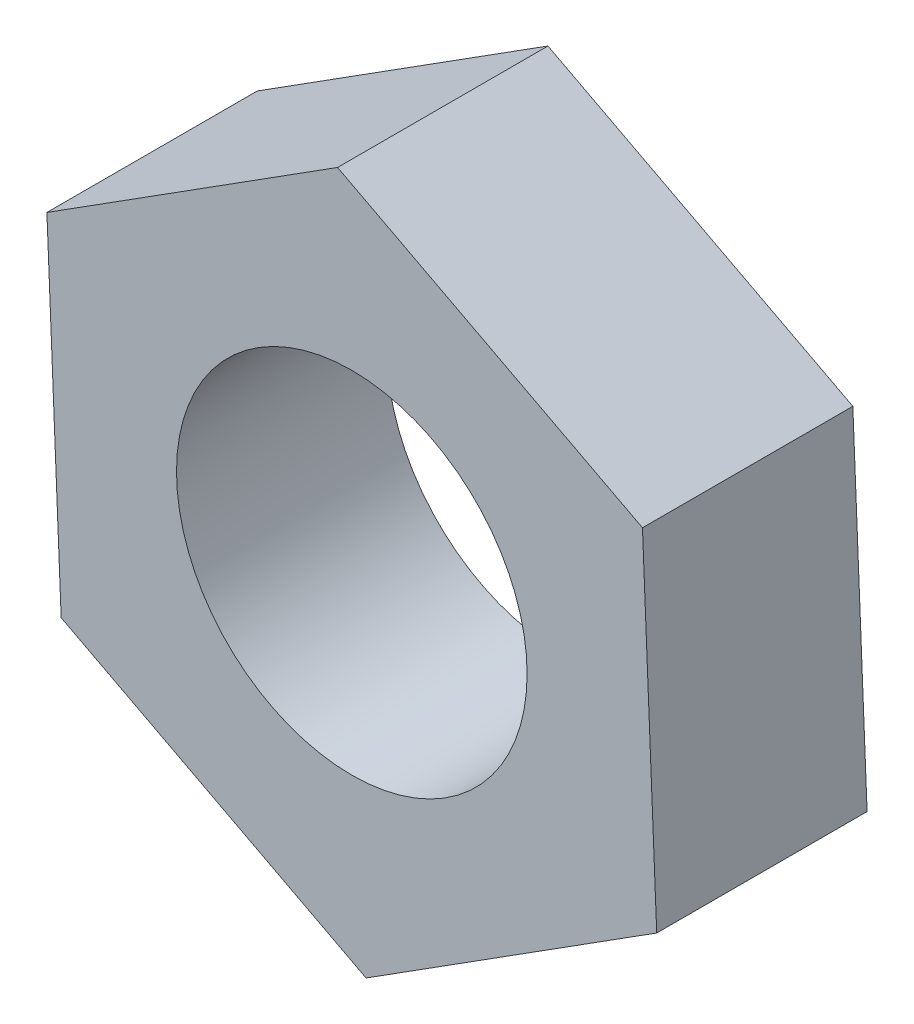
ISO-10303-21;
HEADER;
FILE_DESCRIPTION(('STEP AP214'),'2;1');
FILE_NAME('part.step','',(''),(''),'','','');
FILE_SCHEMA(('AUTOMOTIVE_DESIGN { 1 0 10303 214 1 1 1 1 }'));
ENDSEC;
DATA;
#1=APPLICATION_CONTEXT('core data for automotive mechanical design processes');
#2=APPLICATION_PROTOCOL_DEFINITION('international standard','automotive_design',2000,#1);
#3=PRODUCT_CONTEXT('',#1,'mechanical');
#4=PRODUCT('Part','Part','',(#3));
#5=PRODUCT_RELATED_PRODUCT_CATEGORY('part','',(#4));
#6=PRODUCT_DEFINITION_FORMATION('','',#4);
#7=PRODUCT_DEFINITION_CONTEXT('part definition',#1,'design');
#8=PRODUCT_DEFINITION('design','',#6,#7);
#9=PRODUCT_DEFINITION_SHAPE('','',#8);
#10=(LENGTH_UNIT() NAMED_UNIT(*) SI_UNIT(.MILLI.,.METRE.));
#11=(NAMED_UNIT(*) PLANE_ANGLE_UNIT() SI_UNIT($,.RADIAN.));
#12=(NAMED_UNIT(*) SI_UNIT($,.STERADIAN.) SOLID_ANGLE_UNIT());
#13=UNCERTAINTY_MEASURE_WITH_UNIT(LENGTH_MEASURE(1.E-05),#10,'distance_accuracy_value','');
#14=(GEOMETRIC_REPRESENTATION_CONTEXT(3) GLOBAL_UNCERTAINTY_ASSIGNED_CONTEXT((#13)) GLOBAL_UNIT_ASSIGNED_CONTEXT((#10,
#11,#12)) REPRESENTATION_CONTEXT('',''));
#15=CARTESIAN_POINT('',(0.,0.,0.));
#16=DIRECTION('',(0.,0.,1.));
#17=DIRECTION('',(1.,0.,0.));
#18=AXIS2_PLACEMENT_3D('',#15,#16,#17);
#19=CARTESIAN_POINT('',(0.40656397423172,-9.80653042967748,6.));
#20=DIRECTION('',(-0.535444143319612,0.84457064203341,0.));
#21=DIRECTION('',(-0.84457064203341,-0.535444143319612,0.));
#22=AXIS2_PLACEMENT_3D('',#19,#20,#21);
#23=PLANE('',#22);
#24=DIRECTION('',(0.84457064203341,0.535444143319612,0.));
#25=VECTOR('',#24,1.);
#26=CARTESIAN_POINT('',(0.40656397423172,-9.80653042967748,0.));
#27=LINE('',#26,#25);
#28=CARTESIAN_POINT('',(0.40656397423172,-9.80653042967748,0.));
#29=VERTEX_POINT('',#28);
#30=CARTESIAN_POINT('',(8.69598646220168,-4.55117048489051,0.));
#31=VERTEX_POINT('',#30);
#32=EDGE_CURVE('E117',#29,#31,#27,.T.);
#33=ORIENTED_EDGE('',*,*,#32,.T.);
#34=DIRECTION('',(0.,0.,-1.));
#35=VECTOR('',#34,1.);
#36=CARTESIAN_POINT('',(8.69598646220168,-4.55117048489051,6.));
#37=LINE('',#36,#35);
#38=CARTESIAN_POINT('',(8.69598646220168,-4.55117048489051,6.));
#39=VERTEX_POINT('',#38);
#40=EDGE_CURVE('E11',#39,#31,#37,.T.);
#41=ORIENTED_EDGE('',*,*,#40,.F.);
#42=DIRECTION('',(0.84457064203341,0.535444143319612,0.));
#43=VECTOR('',#42,1.);
#44=CARTESIAN_POINT('',(0.40656397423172,-9.80653042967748,6.));
#45=LINE('',#44,#43);
#46=CARTESIAN_POINT('',(0.40656397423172,-9.80653042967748,6.));
#47=VERTEX_POINT('',#46);
#48=EDGE_CURVE('E127',#47,#39,#45,.T.);
#49=ORIENTED_EDGE('',*,*,#48,.F.);
#50=DIRECTION('',(0.,0.,-1.));
#51=VECTOR('',#50,1.);
#52=CARTESIAN_POINT('',(0.40656397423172,-9.80653042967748,6.));
#53=LINE('',#52,#51);
#54=EDGE_CURVE('E113',#47,#29,#53,.T.);
#55=ORIENTED_EDGE('',*,*,#54,.T.);
#56=EDGE_LOOP('',(#33,#41,#49,#55));
#57=FACE_BOUND('',#56,.T.);
#58=ADVANCED_FACE('F32',(#57),#23,.F.);
#59=CARTESIAN_POINT('',(8.69598646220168,-4.55117048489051,6.));
#60=DIRECTION('',(-0.999141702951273,-0.0414229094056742,0.));
#61=DIRECTION('',(0.0414229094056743,-0.999141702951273,0.));
#62=AXIS2_PLACEMENT_3D('',#59,#60,#61);
#63=PLANE('',#62);
#64=DIRECTION('',(-0.0414229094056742,0.999141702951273,0.));
#65=VECTOR('',#64,1.);
#66=CARTESIAN_POINT('',(8.69598646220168,-4.55117048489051,0.));
#67=LINE('',#66,#65);
#68=CARTESIAN_POINT('',(8.28942248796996,5.25535994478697,0.));
#69=VERTEX_POINT('',#68);
#70=EDGE_CURVE('E120',#31,#69,#67,.T.);
#71=ORIENTED_EDGE('',*,*,#70,.T.);
#72=DIRECTION('',(0.,0.,-1.));
#73=VECTOR('',#72,1.);
#74=CARTESIAN_POINT('',(8.28942248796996,5.25535994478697,6.));
#75=LINE('',#74,#73);
#76=CARTESIAN_POINT('',(8.28942248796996,5.25535994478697,6.));
#77=VERTEX_POINT('',#76);
#78=EDGE_CURVE('E41',#77,#69,#75,.T.);
#79=ORIENTED_EDGE('',*,*,#78,.F.);
#80=DIRECTION('',(-0.0414229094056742,0.999141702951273,0.));
#81=VECTOR('',#80,1.);
#82=CARTESIAN_POINT('',(8.69598646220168,-4.55117048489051,6.));
#83=LINE('',#82,#81);
#84=EDGE_CURVE('E86',#39,#77,#83,.T.);
#85=ORIENTED_EDGE('',*,*,#84,.F.);
#86=ORIENTED_EDGE('',*,*,#40,.T.);
#87=EDGE_LOOP('',(#71,#79,#85,#86));
#88=FACE_BOUND('',#87,.T.);
#89=ADVANCED_FACE('F154',(#88),#63,.F.);
#90=CARTESIAN_POINT('',(8.28942248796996,5.25535994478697,6.));
#91=DIRECTION('',(-0.463697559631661,-0.885993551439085,0.));
#92=DIRECTION('',(0.885993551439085,-0.463697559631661,0.));
#93=AXIS2_PLACEMENT_3D('',#90,#91,#92);
#94=PLANE('',#93);
#95=DIRECTION('',(-0.885993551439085,0.463697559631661,0.));
#96=VECTOR('',#95,1.);
#97=CARTESIAN_POINT('',(8.28942248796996,5.25535994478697,0.));
#98=LINE('',#97,#96);
#99=CARTESIAN_POINT('',(-0.406563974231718,9.80653042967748,0.));
#100=VERTEX_POINT('',#99);
#101=EDGE_CURVE('E122',#69,#100,#98,.T.);
#102=ORIENTED_EDGE('',*,*,#101,.T.);
#103=DIRECTION('',(0.,0.,-1.));
#104=VECTOR('',#103,1.);
#105=CARTESIAN_POINT('',(-0.406563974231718,9.80653042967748,6.));
#106=LINE('',#105,#104);
#107=CARTESIAN_POINT('',(-0.406563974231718,9.80653042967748,6.));
#108=VERTEX_POINT('',#107);
#109=EDGE_CURVE('E108',#108,#100,#106,.T.);
#110=ORIENTED_EDGE('',*,*,#109,.F.);
#111=DIRECTION('',(-0.885993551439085,0.463697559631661,0.));
#112=VECTOR('',#111,1.);
#113=CARTESIAN_POINT('',(8.28942248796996,5.25535994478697,6.));
#114=LINE('',#113,#112);
#115=EDGE_CURVE('E99',#77,#108,#114,.T.);
#116=ORIENTED_EDGE('',*,*,#115,.F.);
#117=ORIENTED_EDGE('',*,*,#78,.T.);
#118=EDGE_LOOP('',(#102,#110,#116,#117));
#119=FACE_BOUND('',#118,.T.);
#120=ADVANCED_FACE('F134',(#119),#94,.F.);
#121=CARTESIAN_POINT('',(-0.406563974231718,9.80653042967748,6.));
#122=DIRECTION('',(0.535444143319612,-0.84457064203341,0.));
#123=DIRECTION('',(0.844570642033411,0.535444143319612,0.));
#124=AXIS2_PLACEMENT_3D('',#121,#122,#123);
#125=PLANE('',#124);
#126=DIRECTION('',(-0.844570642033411,-0.535444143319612,0.));
#127=VECTOR('',#126,1.);
#128=CARTESIAN_POINT('',(-0.406563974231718,9.80653042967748,0.));
#129=LINE('',#128,#127);
#130=CARTESIAN_POINT('',(-8.69598646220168,4.55117048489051,0.));
#131=VERTEX_POINT('',#130);
#132=EDGE_CURVE('E107',#100,#131,#129,.T.);
#133=ORIENTED_EDGE('',*,*,#132,.T.);
#134=DIRECTION('',(0.,0.,-1.));
#135=VECTOR('',#134,1.);
#136=CARTESIAN_POINT('',(-8.69598646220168,4.55117048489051,6.));
#137=LINE('',#136,#135);
#138=CARTESIAN_POINT('',(-8.69598646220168,4.55117048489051,6.));
#139=VERTEX_POINT('',#138);
#140=EDGE_CURVE('E104',#139,#131,#137,.T.);
#141=ORIENTED_EDGE('',*,*,#140,.F.);
#142=DIRECTION('',(-0.844570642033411,-0.535444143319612,0.));
#143=VECTOR('',#142,1.);
#144=CARTESIAN_POINT('',(-0.406563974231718,9.80653042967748,6.));
#145=LINE('',#144,#143);
#146=EDGE_CURVE('E93',#108,#139,#145,.T.);
#147=ORIENTED_EDGE('',*,*,#146,.F.);
#148=ORIENTED_EDGE('',*,*,#109,.T.);
#149=EDGE_LOOP('',(#133,#141,#147,#148));
#150=FACE_BOUND('',#149,.T.);
#151=ADVANCED_FACE('F105',(#150),#125,.F.);
#152=CARTESIAN_POINT('',(-8.69598646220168,4.55117048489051,6.));
#153=DIRECTION('',(0.999141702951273,0.0414229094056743,0.));
#154=DIRECTION('',(-0.0414229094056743,0.999141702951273,0.));
#155=AXIS2_PLACEMENT_3D('',#152,#153,#154);
#156=PLANE('',#155);
#157=DIRECTION('',(0.0414229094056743,-0.999141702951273,0.));
#158=VECTOR('',#157,1.);
#159=CARTESIAN_POINT('',(-8.69598646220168,4.55117048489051,0.));
#160=LINE('',#159,#158);
#161=CARTESIAN_POINT('',(-8.28942248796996,-5.25535994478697,0.));
#162=VERTEX_POINT('',#161);
#163=EDGE_CURVE('E72',#131,#162,#160,.T.);
#164=ORIENTED_EDGE('',*,*,#163,.T.);
#165=DIRECTION('',(0.,0.,-1.));
#166=VECTOR('',#165,1.);
#167=CARTESIAN_POINT('',(-8.28942248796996,-5.25535994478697,6.));
#168=LINE('',#167,#166);
#169=CARTESIAN_POINT('',(-8.28942248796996,-5.25535994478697,6.));
#170=VERTEX_POINT('',#169);
#171=EDGE_CURVE('E109',#170,#162,#168,.T.);
#172=ORIENTED_EDGE('',*,*,#171,.F.);
#173=DIRECTION('',(0.0414229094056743,-0.999141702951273,0.));
#174=VECTOR('',#173,1.);
#175=CARTESIAN_POINT('',(-8.69598646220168,4.55117048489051,6.));
#176=LINE('',#175,#174);
#177=EDGE_CURVE('E97',#139,#170,#176,.T.);
#178=ORIENTED_EDGE('',*,*,#177,.F.);
#179=ORIENTED_EDGE('',*,*,#140,.T.);
#180=EDGE_LOOP('',(#164,#172,#178,#179));
#181=FACE_BOUND('',#180,.T.);
#182=ADVANCED_FACE('F111',(#181),#156,.F.);
#183=CARTESIAN_POINT('',(-8.28942248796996,-5.25535994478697,6.));
#184=DIRECTION('',(0.463697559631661,0.885993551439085,0.));
#185=DIRECTION('',(-0.885993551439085,0.463697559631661,0.));
#186=AXIS2_PLACEMENT_3D('',#183,#184,#185);
#187=PLANE('',#186);
#188=DIRECTION('',(0.885993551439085,-0.463697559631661,0.));
#189=VECTOR('',#188,1.);
#190=CARTESIAN_POINT('',(-8.28942248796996,-5.25535994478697,0.));
#191=LINE('',#190,#189);
#192=EDGE_CURVE('E78',#162,#29,#191,.T.);
#193=ORIENTED_EDGE('',*,*,#192,.T.);
#194=ORIENTED_EDGE('',*,*,#54,.F.);
#195=DIRECTION('',(0.885993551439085,-0.463697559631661,0.));
#196=VECTOR('',#195,1.);
#197=CARTESIAN_POINT('',(-8.28942248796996,-5.25535994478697,6.));
#198=LINE('',#197,#196);
#199=EDGE_CURVE('E49',#170,#47,#198,.T.);
#200=ORIENTED_EDGE('',*,*,#199,.F.);
#201=ORIENTED_EDGE('',*,*,#171,.T.);
#202=EDGE_LOOP('',(#193,#194,#200,#201));
#203=FACE_BOUND('',#202,.T.);
#204=ADVANCED_FACE('F141',(#203),#187,.F.);
#205=CARTESIAN_POINT('',(8.69598646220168,-4.5511704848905,6.));
#206=DIRECTION('',(0.,0.,1.));
#207=DIRECTION('',(1.,0.,0.));
#208=AXIS2_PLACEMENT_3D('',#205,#206,#207);
#209=PLANE('',#208);
#210=CARTESIAN_POINT('',(0.,0.,6.));
#211=DIRECTION('',(0.,0.,1.));
#212=DIRECTION('',(1.,0.,0.));
#213=AXIS2_PLACEMENT_3D('',#210,#211,#212);
#214=CIRCLE('',#213,4.99999999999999);
#215=CARTESIAN_POINT('',(4.99999999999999,0.,6.));
#216=VERTEX_POINT('',#215);
#217=EDGE_CURVE('E206',#216,#216,#214,.T.);
#218=ORIENTED_EDGE('',*,*,#217,.F.);
#219=EDGE_LOOP('',(#218));
#220=FACE_BOUND('',#219,.T.);
#221=ORIENTED_EDGE('',*,*,#48,.T.);
#222=ORIENTED_EDGE('',*,*,#84,.T.);
#223=ORIENTED_EDGE('',*,*,#115,.T.);
#224=ORIENTED_EDGE('',*,*,#146,.T.);
#225=ORIENTED_EDGE('',*,*,#177,.T.);
#226=ORIENTED_EDGE('',*,*,#199,.T.);
#227=EDGE_LOOP('',(#221,#222,#223,#224,#225,#226));
#228=FACE_BOUND('',#227,.T.);
#229=ADVANCED_FACE('F95',(#220,#228),#209,.T.);
#230=CARTESIAN_POINT('',(8.69598646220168,-4.5511704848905,0.));
#231=DIRECTION('',(0.,0.,1.));
#232=DIRECTION('',(1.,0.,0.));
#233=AXIS2_PLACEMENT_3D('',#230,#231,#232);
#234=PLANE('',#233);
#235=CARTESIAN_POINT('',(0.,0.,0.));
#236=DIRECTION('',(0.,0.,1.));
#237=DIRECTION('',(1.,0.,0.));
#238=AXIS2_PLACEMENT_3D('',#235,#236,#237);
#239=CIRCLE('',#238,4.99999999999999);
#240=CARTESIAN_POINT('',(4.99999999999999,0.,0.));
#241=VERTEX_POINT('',#240);
#242=EDGE_CURVE('E35',#241,#241,#239,.T.);
#243=ORIENTED_EDGE('',*,*,#242,.T.);
#244=EDGE_LOOP('',(#243));
#245=FACE_BOUND('',#244,.T.);
#246=ORIENTED_EDGE('',*,*,#32,.F.);
#247=ORIENTED_EDGE('',*,*,#192,.F.);
#248=ORIENTED_EDGE('',*,*,#163,.F.);
#249=ORIENTED_EDGE('',*,*,#132,.F.);
#250=ORIENTED_EDGE('',*,*,#101,.F.);
#251=ORIENTED_EDGE('',*,*,#70,.F.);
#252=EDGE_LOOP('',(#246,#247,#248,#249,#250,#251));
#253=FACE_BOUND('',#252,.T.);
#254=ADVANCED_FACE('F137',(#245,#253),#234,.F.);
#255=CARTESIAN_POINT('',(0.,0.,6.));
#256=DIRECTION('',(0.,0.,1.));
#257=DIRECTION('',(1.,0.,0.));
#258=AXIS2_PLACEMENT_3D('',#255,#256,#257);
#259=CYLINDRICAL_SURFACE('',#258,4.99999999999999);
#260=ORIENTED_EDGE('',*,*,#217,.T.);
#261=EDGE_LOOP('',(#260));
#262=FACE_BOUND('',#261,.T.);
#263=ORIENTED_EDGE('',*,*,#242,.F.);
#264=EDGE_LOOP('',(#263));
#265=FACE_BOUND('',#264,.T.);
#266=ADVANCED_FACE('F187',(#262,#265),#259,.F.);
#267=CLOSED_SHELL('',(#58,#89,#120,#151,#182,#204,#229,#254,#266));
#268=MANIFOLD_SOLID_BREP('B2',#267);
#269=ADVANCED_BREP_SHAPE_REPRESENTATION('',(#18,#268),#14);
#270=SHAPE_DEFINITION_REPRESENTATION(#9,#269);
ENDSEC;
END-ISO-10303-21;
